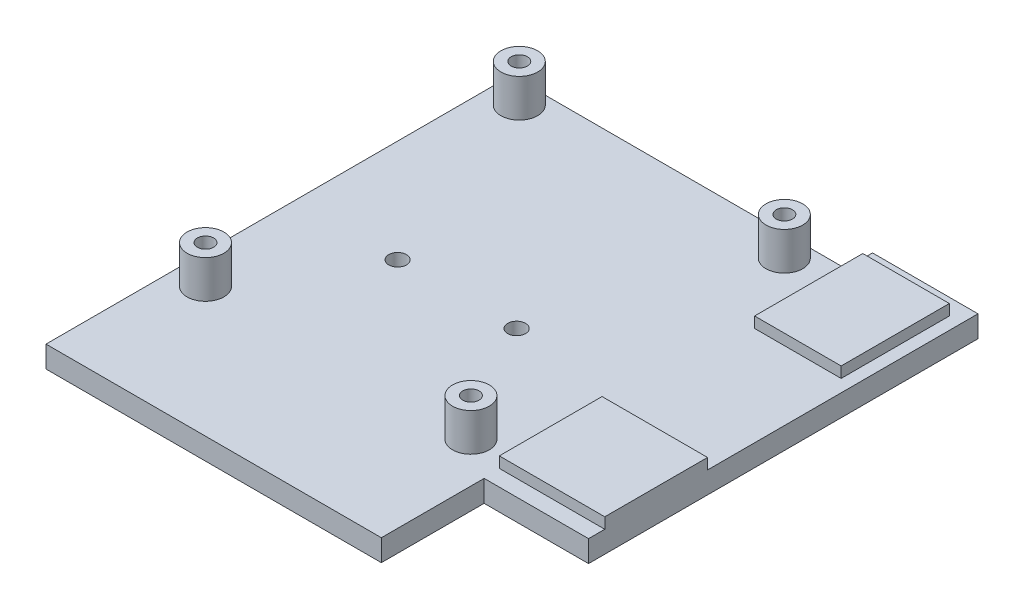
ISO-10303-21;
HEADER;
FILE_DESCRIPTION(('STEP AP214'),'2;1');
FILE_NAME('part.step','',(''),(''),'','','');
FILE_SCHEMA(('AUTOMOTIVE_DESIGN { 1 0 10303 214 1 1 1 1 }'));
ENDSEC;
DATA;
#1=APPLICATION_CONTEXT('core data for automotive mechanical design processes');
#2=APPLICATION_PROTOCOL_DEFINITION('international standard','automotive_design',2000,#1);
#3=PRODUCT_CONTEXT('',#1,'mechanical');
#4=PRODUCT('Part','Part','',(#3));
#5=PRODUCT_RELATED_PRODUCT_CATEGORY('part','',(#4));
#6=PRODUCT_DEFINITION_FORMATION('','',#4);
#7=PRODUCT_DEFINITION_CONTEXT('part definition',#1,'design');
#8=PRODUCT_DEFINITION('design','',#6,#7);
#9=PRODUCT_DEFINITION_SHAPE('','',#8);
#10=(LENGTH_UNIT() NAMED_UNIT(*) SI_UNIT(.MILLI.,.METRE.));
#11=(NAMED_UNIT(*) PLANE_ANGLE_UNIT() SI_UNIT($,.RADIAN.));
#12=(NAMED_UNIT(*) SI_UNIT($,.STERADIAN.) SOLID_ANGLE_UNIT());
#13=UNCERTAINTY_MEASURE_WITH_UNIT(LENGTH_MEASURE(1.E-05),#10,'distance_accuracy_value','');
#14=(GEOMETRIC_REPRESENTATION_CONTEXT(3) GLOBAL_UNCERTAINTY_ASSIGNED_CONTEXT((#13)) GLOBAL_UNIT_ASSIGNED_CONTEXT((#10,
#11,#12)) REPRESENTATION_CONTEXT('',''));
#15=CARTESIAN_POINT('',(0.,0.,0.));
#16=DIRECTION('',(0.,0.,1.));
#17=DIRECTION('',(1.,0.,0.));
#18=AXIS2_PLACEMENT_3D('',#15,#16,#17);
#19=CARTESIAN_POINT('',(33.,19.,-255.));
#20=DIRECTION('',(0.,1.,0.));
#21=DIRECTION('',(0.,0.,1.));
#22=AXIS2_PLACEMENT_3D('',#19,#20,#21);
#23=PLANE('',#22);
#24=DIRECTION('',(1.,0.,0.));
#25=VECTOR('',#24,1.);
#26=CARTESIAN_POINT('',(33.,19.,-235.));
#27=LINE('',#26,#25);
#28=CARTESIAN_POINT('',(49.,19.,-235.));
#29=VERTEX_POINT('',#28);
#30=CARTESIAN_POINT('',(33.,19.,-235.));
#31=VERTEX_POINT('',#30);
#32=EDGE_CURVE('E133',#29,#31,#27,.F.);
#33=ORIENTED_EDGE('',*,*,#32,.F.);
#34=DIRECTION('',(0.,0.,-1.));
#35=VECTOR('',#34,1.);
#36=CARTESIAN_POINT('',(49.,19.,-255.));
#37=LINE('',#36,#35);
#38=CARTESIAN_POINT('',(49.,19.,-255.));
#39=VERTEX_POINT('',#38);
#40=EDGE_CURVE('E283',#39,#29,#37,.F.);
#41=ORIENTED_EDGE('',*,*,#40,.F.);
#42=DIRECTION('',(1.,0.,0.));
#43=VECTOR('',#42,1.);
#44=CARTESIAN_POINT('',(33.,19.,-255.));
#45=LINE('',#44,#43);
#46=CARTESIAN_POINT('',(33.,19.,-255.));
#47=VERTEX_POINT('',#46);
#48=EDGE_CURVE('E147',#39,#47,#45,.F.);
#49=ORIENTED_EDGE('',*,*,#48,.T.);
#50=DIRECTION('',(0.,0.,-1.));
#51=VECTOR('',#50,1.);
#52=CARTESIAN_POINT('',(33.,19.,-255.));
#53=LINE('',#52,#51);
#54=EDGE_CURVE('E127',#47,#31,#53,.F.);
#55=ORIENTED_EDGE('',*,*,#54,.T.);
#56=EDGE_LOOP('',(#33,#41,#49,#55));
#57=FACE_BOUND('',#56,.T.);
#58=ADVANCED_FACE('F16',(#57),#23,.T.);
#59=CARTESIAN_POINT('',(33.,16.9,-235.));
#60=DIRECTION('',(0.,0.,1.));
#61=DIRECTION('',(1.,0.,0.));
#62=AXIS2_PLACEMENT_3D('',#59,#60,#61);
#63=PLANE('',#62);
#64=DIRECTION('',(0.,1.,0.));
#65=VECTOR('',#64,1.);
#66=CARTESIAN_POINT('',(49.,16.9,-235.));
#67=LINE('',#66,#65);
#68=CARTESIAN_POINT('',(49.,17.,-235.));
#69=VERTEX_POINT('',#68);
#70=EDGE_CURVE('E138',#29,#69,#67,.F.);
#71=ORIENTED_EDGE('',*,*,#70,.F.);
#72=ORIENTED_EDGE('',*,*,#32,.T.);
#73=DIRECTION('',(0.,1.,0.));
#74=VECTOR('',#73,1.);
#75=CARTESIAN_POINT('',(33.,16.9,-235.));
#76=LINE('',#75,#74);
#77=CARTESIAN_POINT('',(33.,17.,-235.));
#78=VERTEX_POINT('',#77);
#79=EDGE_CURVE('E136',#31,#78,#76,.F.);
#80=ORIENTED_EDGE('',*,*,#79,.T.);
#81=DIRECTION('',(1.,0.,0.));
#82=VECTOR('',#81,1.);
#83=CARTESIAN_POINT('',(31.8,17.,-235.));
#84=LINE('',#83,#82);
#85=EDGE_CURVE('E266',#69,#78,#84,.F.);
#86=ORIENTED_EDGE('',*,*,#85,.F.);
#87=EDGE_LOOP('',(#71,#72,#80,#86));
#88=FACE_BOUND('',#87,.T.);
#89=ADVANCED_FACE('F134',(#88),#63,.T.);
#90=CARTESIAN_POINT('',(33.,16.9,-255.));
#91=DIRECTION('',(1.,0.,0.));
#92=DIRECTION('',(0.,0.,-1.));
#93=AXIS2_PLACEMENT_3D('',#90,#91,#92);
#94=PLANE('',#93);
#95=DIRECTION('',(0.,1.,0.));
#96=VECTOR('',#95,1.);
#97=CARTESIAN_POINT('',(33.,16.9,-255.));
#98=LINE('',#97,#96);
#99=CARTESIAN_POINT('',(33.,17.,-255.));
#100=VERTEX_POINT('',#99);
#101=EDGE_CURVE('E148',#47,#100,#98,.F.);
#102=ORIENTED_EDGE('',*,*,#101,.T.);
#103=DIRECTION('',(0.,0.,1.));
#104=VECTOR('',#103,1.);
#105=CARTESIAN_POINT('',(33.,17.,-258.));
#106=LINE('',#105,#104);
#107=EDGE_CURVE('E144',#78,#100,#106,.F.);
#108=ORIENTED_EDGE('',*,*,#107,.F.);
#109=ORIENTED_EDGE('',*,*,#79,.F.);
#110=ORIENTED_EDGE('',*,*,#54,.F.);
#111=EDGE_LOOP('',(#102,#108,#109,#110));
#112=FACE_BOUND('',#111,.T.);
#113=ADVANCED_FACE('F143',(#112),#94,.F.);
#114=CARTESIAN_POINT('',(33.,16.9,-255.));
#115=DIRECTION('',(0.,0.,1.));
#116=DIRECTION('',(1.,0.,0.));
#117=AXIS2_PLACEMENT_3D('',#114,#115,#116);
#118=PLANE('',#117);
#119=DIRECTION('',(0.,1.,0.));
#120=VECTOR('',#119,1.);
#121=CARTESIAN_POINT('',(49.,16.9,-255.));
#122=LINE('',#121,#120);
#123=CARTESIAN_POINT('',(49.,17.,-255.));
#124=VERTEX_POINT('',#123);
#125=EDGE_CURVE('E285',#124,#39,#122,.T.);
#126=ORIENTED_EDGE('',*,*,#125,.F.);
#127=DIRECTION('',(1.,0.,0.));
#128=VECTOR('',#127,1.);
#129=CARTESIAN_POINT('',(31.8,17.,-255.));
#130=LINE('',#129,#128);
#131=EDGE_CURVE('E263',#100,#124,#130,.T.);
#132=ORIENTED_EDGE('',*,*,#131,.F.);
#133=ORIENTED_EDGE('',*,*,#101,.F.);
#134=ORIENTED_EDGE('',*,*,#48,.F.);
#135=EDGE_LOOP('',(#126,#132,#133,#134));
#136=FACE_BOUND('',#135,.T.);
#137=ADVANCED_FACE('F296',(#136),#118,.F.);
#138=CARTESIAN_POINT('',(49.,16.9,-255.));
#139=DIRECTION('',(1.,0.,0.));
#140=DIRECTION('',(0.,0.,-1.));
#141=AXIS2_PLACEMENT_3D('',#138,#139,#140);
#142=PLANE('',#141);
#143=ORIENTED_EDGE('',*,*,#125,.T.);
#144=ORIENTED_EDGE('',*,*,#40,.T.);
#145=ORIENTED_EDGE('',*,*,#70,.T.);
#146=DIRECTION('',(0.,0.,1.));
#147=VECTOR('',#146,1.);
#148=CARTESIAN_POINT('',(49.,17.,-258.));
#149=LINE('',#148,#147);
#150=EDGE_CURVE('E260',#124,#69,#149,.T.);
#151=ORIENTED_EDGE('',*,*,#150,.F.);
#152=EDGE_LOOP('',(#143,#144,#145,#151));
#153=FACE_BOUND('',#152,.T.);
#154=ADVANCED_FACE('F290',(#153),#142,.T.);
#155=CARTESIAN_POINT('',(31.8,16.9,-189.));
#156=DIRECTION('',(0.,0.,1.));
#157=DIRECTION('',(1.,0.,0.));
#158=AXIS2_PLACEMENT_3D('',#155,#156,#157);
#159=PLANE('',#158);
#160=DIRECTION('',(0.,1.,0.));
#161=VECTOR('',#160,1.);
#162=CARTESIAN_POINT('',(51.3,16.9,-189.));
#163=LINE('',#162,#161);
#164=CARTESIAN_POINT('',(51.3,17.,-189.));
#165=VERTEX_POINT('',#164);
#166=CARTESIAN_POINT('',(51.3,19.,-189.));
#167=VERTEX_POINT('',#166);
#168=EDGE_CURVE('E281',#165,#167,#163,.T.);
#169=ORIENTED_EDGE('',*,*,#168,.T.);
#170=DIRECTION('',(1.,0.,0.));
#171=VECTOR('',#170,1.);
#172=CARTESIAN_POINT('',(31.8,19.,-189.));
#173=LINE('',#172,#171);
#174=CARTESIAN_POINT('',(31.8,19.,-189.));
#175=VERTEX_POINT('',#174);
#176=EDGE_CURVE('E274',#175,#167,#173,.T.);
#177=ORIENTED_EDGE('',*,*,#176,.F.);
#178=DIRECTION('',(0.,1.,0.));
#179=VECTOR('',#178,1.);
#180=CARTESIAN_POINT('',(31.8,16.9,-189.));
#181=LINE('',#180,#179);
#182=CARTESIAN_POINT('',(31.8,17.,-189.));
#183=VERTEX_POINT('',#182);
#184=EDGE_CURVE('E245',#175,#183,#181,.F.);
#185=ORIENTED_EDGE('',*,*,#184,.T.);
#186=DIRECTION('',(1.,0.,0.));
#187=VECTOR('',#186,1.);
#188=CARTESIAN_POINT('',(-30.,17.,-189.));
#189=LINE('',#188,#187);
#190=EDGE_CURVE('E248',#165,#183,#189,.F.);
#191=ORIENTED_EDGE('',*,*,#190,.F.);
#192=EDGE_LOOP('',(#169,#177,#185,#191));
#193=FACE_BOUND('',#192,.T.);
#194=ADVANCED_FACE('F304',(#193),#159,.T.);
#195=CARTESIAN_POINT('',(31.8,16.9,-208.));
#196=DIRECTION('',(0.,0.,1.));
#197=DIRECTION('',(1.,0.,0.));
#198=AXIS2_PLACEMENT_3D('',#195,#196,#197);
#199=PLANE('',#198);
#200=DIRECTION('',(0.,1.,0.));
#201=VECTOR('',#200,1.);
#202=CARTESIAN_POINT('',(51.3,16.9,-208.));
#203=LINE('',#202,#201);
#204=CARTESIAN_POINT('',(51.3,17.,-208.));
#205=VERTEX_POINT('',#204);
#206=CARTESIAN_POINT('',(51.3,19.,-208.));
#207=VERTEX_POINT('',#206);
#208=EDGE_CURVE('E279',#205,#207,#203,.T.);
#209=ORIENTED_EDGE('',*,*,#208,.F.);
#210=DIRECTION('',(1.,0.,0.));
#211=VECTOR('',#210,1.);
#212=CARTESIAN_POINT('',(31.8,17.,-208.));
#213=LINE('',#212,#211);
#214=CARTESIAN_POINT('',(31.8,17.,-208.));
#215=VERTEX_POINT('',#214);
#216=EDGE_CURVE('E268',#215,#205,#213,.T.);
#217=ORIENTED_EDGE('',*,*,#216,.F.);
#218=DIRECTION('',(0.,1.,0.));
#219=VECTOR('',#218,1.);
#220=CARTESIAN_POINT('',(31.8,16.9,-208.));
#221=LINE('',#220,#219);
#222=CARTESIAN_POINT('',(31.8,19.,-208.));
#223=VERTEX_POINT('',#222);
#224=EDGE_CURVE('E242',#215,#223,#221,.T.);
#225=ORIENTED_EDGE('',*,*,#224,.T.);
#226=DIRECTION('',(1.,0.,0.));
#227=VECTOR('',#226,1.);
#228=CARTESIAN_POINT('',(31.8,19.,-208.));
#229=LINE('',#228,#227);
#230=EDGE_CURVE('E277',#207,#223,#229,.F.);
#231=ORIENTED_EDGE('',*,*,#230,.F.);
#232=EDGE_LOOP('',(#209,#217,#225,#231));
#233=FACE_BOUND('',#232,.T.);
#234=ADVANCED_FACE('F412',(#233),#199,.F.);
#235=CARTESIAN_POINT('',(31.8,19.,-208.));
#236=DIRECTION('',(0.,1.,0.));
#237=DIRECTION('',(0.,0.,1.));
#238=AXIS2_PLACEMENT_3D('',#235,#236,#237);
#239=PLANE('',#238);
#240=ORIENTED_EDGE('',*,*,#176,.T.);
#241=DIRECTION('',(0.,0.,1.));
#242=VECTOR('',#241,1.);
#243=CARTESIAN_POINT('',(51.3,19.,-208.));
#244=LINE('',#243,#242);
#245=EDGE_CURVE('E271',#167,#207,#244,.F.);
#246=ORIENTED_EDGE('',*,*,#245,.T.);
#247=ORIENTED_EDGE('',*,*,#230,.T.);
#248=DIRECTION('',(0.,0.,-1.));
#249=VECTOR('',#248,1.);
#250=CARTESIAN_POINT('',(31.8,19.,-208.));
#251=LINE('',#250,#249);
#252=EDGE_CURVE('E239',#223,#175,#251,.F.);
#253=ORIENTED_EDGE('',*,*,#252,.T.);
#254=EDGE_LOOP('',(#240,#246,#247,#253));
#255=FACE_BOUND('',#254,.T.);
#256=ADVANCED_FACE('F408',(#255),#239,.T.);
#257=CARTESIAN_POINT('',(51.3,13.,-258.));
#258=DIRECTION('',(1.,0.,0.));
#259=DIRECTION('',(0.,0.,-1.));
#260=AXIS2_PLACEMENT_3D('',#257,#258,#259);
#261=PLANE('',#260);
#262=DIRECTION('',(0.,0.,-1.));
#263=VECTOR('',#262,1.);
#264=CARTESIAN_POINT('',(51.3,17.,-258.));
#265=LINE('',#264,#263);
#266=CARTESIAN_POINT('',(51.3,17.,-258.));
#267=VERTEX_POINT('',#266);
#268=EDGE_CURVE('E257',#267,#205,#265,.F.);
#269=ORIENTED_EDGE('',*,*,#268,.T.);
#270=ORIENTED_EDGE('',*,*,#208,.T.);
#271=ORIENTED_EDGE('',*,*,#245,.F.);
#272=ORIENTED_EDGE('',*,*,#168,.F.);
#273=DIRECTION('',(0.,0.,-1.));
#274=VECTOR('',#273,1.);
#275=CARTESIAN_POINT('',(51.3,17.,-258.));
#276=LINE('',#275,#274);
#277=CARTESIAN_POINT('',(51.3,17.,-186.));
#278=VERTEX_POINT('',#277);
#279=EDGE_CURVE('E255',#165,#278,#276,.F.);
#280=ORIENTED_EDGE('',*,*,#279,.T.);
#281=DIRECTION('',(0.,1.,0.));
#282=VECTOR('',#281,1.);
#283=CARTESIAN_POINT('',(51.3,13.,-186.));
#284=LINE('',#283,#282);
#285=CARTESIAN_POINT('',(51.3,13.,-186.));
#286=VERTEX_POINT('',#285);
#287=EDGE_CURVE('E229',#286,#278,#284,.T.);
#288=ORIENTED_EDGE('',*,*,#287,.F.);
#289=DIRECTION('',(0.,0.,1.));
#290=VECTOR('',#289,1.);
#291=CARTESIAN_POINT('',(51.3,13.,-258.));
#292=LINE('',#291,#290);
#293=CARTESIAN_POINT('',(51.3,13.,-258.));
#294=VERTEX_POINT('',#293);
#295=EDGE_CURVE('E226',#286,#294,#292,.F.);
#296=ORIENTED_EDGE('',*,*,#295,.T.);
#297=DIRECTION('',(0.,1.,0.));
#298=VECTOR('',#297,1.);
#299=CARTESIAN_POINT('',(51.3,13.,-258.));
#300=LINE('',#299,#298);
#301=EDGE_CURVE('E252',#294,#267,#300,.T.);
#302=ORIENTED_EDGE('',*,*,#301,.T.);
#303=EDGE_LOOP('',(#269,#270,#271,#272,#280,#288,#296,#302));
#304=FACE_BOUND('',#303,.T.);
#305=ADVANCED_FACE('F404',(#304),#261,.T.);
#306=CARTESIAN_POINT('',(31.8,13.,-258.));
#307=DIRECTION('',(0.,0.,1.));
#308=DIRECTION('',(1.,0.,0.));
#309=AXIS2_PLACEMENT_3D('',#306,#307,#308);
#310=PLANE('',#309);
#311=ORIENTED_EDGE('',*,*,#301,.F.);
#312=DIRECTION('',(1.,0.,0.));
#313=VECTOR('',#312,1.);
#314=CARTESIAN_POINT('',(31.8,13.,-258.));
#315=LINE('',#314,#313);
#316=CARTESIAN_POINT('',(31.8,13.,-258.));
#317=VERTEX_POINT('',#316);
#318=EDGE_CURVE('E219',#294,#317,#315,.F.);
#319=ORIENTED_EDGE('',*,*,#318,.T.);
#320=DIRECTION('',(0.,1.,0.));
#321=VECTOR('',#320,1.);
#322=CARTESIAN_POINT('',(31.8,13.,-258.));
#323=LINE('',#322,#321);
#324=CARTESIAN_POINT('',(31.8,17.,-258.));
#325=VERTEX_POINT('',#324);
#326=EDGE_CURVE('E236',#317,#325,#323,.T.);
#327=ORIENTED_EDGE('',*,*,#326,.T.);
#328=DIRECTION('',(1.,0.,0.));
#329=VECTOR('',#328,1.);
#330=CARTESIAN_POINT('',(31.8,17.,-258.));
#331=LINE('',#330,#329);
#332=EDGE_CURVE('E250',#267,#325,#331,.F.);
#333=ORIENTED_EDGE('',*,*,#332,.F.);
#334=EDGE_LOOP('',(#311,#319,#327,#333));
#335=FACE_BOUND('',#334,.T.);
#336=ADVANCED_FACE('F400',(#335),#310,.F.);
#337=CARTESIAN_POINT('',(31.8,16.9,-208.));
#338=DIRECTION('',(1.,0.,0.));
#339=DIRECTION('',(0.,0.,-1.));
#340=AXIS2_PLACEMENT_3D('',#337,#338,#339);
#341=PLANE('',#340);
#342=ORIENTED_EDGE('',*,*,#224,.F.);
#343=DIRECTION('',(0.,0.,1.));
#344=VECTOR('',#343,1.);
#345=CARTESIAN_POINT('',(31.8,17.,-253.));
#346=LINE('',#345,#344);
#347=EDGE_CURVE('E204',#183,#215,#346,.F.);
#348=ORIENTED_EDGE('',*,*,#347,.F.);
#349=ORIENTED_EDGE('',*,*,#184,.F.);
#350=ORIENTED_EDGE('',*,*,#252,.F.);
#351=EDGE_LOOP('',(#342,#348,#349,#350));
#352=FACE_BOUND('',#351,.T.);
#353=ADVANCED_FACE('F396',(#352),#341,.F.);
#354=CARTESIAN_POINT('',(-24.5099,16.8,-249.0098));
#355=DIRECTION('',(0.,1.,0.));
#356=DIRECTION('',(0.,0.,1.));
#357=AXIS2_PLACEMENT_3D('',#354,#355,#356);
#358=CYLINDRICAL_SURFACE('',#357,3.4);
#359=CARTESIAN_POINT('',(-24.5099,24.,-249.0098));
#360=DIRECTION('',(0.,1.,0.));
#361=DIRECTION('',(0.,0.,1.));
#362=AXIS2_PLACEMENT_3D('',#359,#360,#361);
#363=CIRCLE('',#362,3.4);
#364=CARTESIAN_POINT('',(-24.5099,24.,-245.6098));
#365=VERTEX_POINT('',#364);
#366=EDGE_CURVE('E19',#365,#365,#363,.T.);
#367=ORIENTED_EDGE('',*,*,#366,.F.);
#368=EDGE_LOOP('',(#367));
#369=FACE_BOUND('',#368,.T.);
#370=CARTESIAN_POINT('',(-24.5099,17.,-249.0098));
#371=DIRECTION('',(0.,1.,0.));
#372=DIRECTION('',(0.,0.,1.));
#373=AXIS2_PLACEMENT_3D('',#370,#371,#372);
#374=CIRCLE('',#373,3.4);
#375=CARTESIAN_POINT('',(-24.5099,17.,-245.6098));
#376=VERTEX_POINT('',#375);
#377=EDGE_CURVE('E201',#376,#376,#374,.F.);
#378=ORIENTED_EDGE('',*,*,#377,.F.);
#379=EDGE_LOOP('',(#378));
#380=FACE_BOUND('',#379,.T.);
#381=ADVANCED_FACE('F392',(#369,#380),#358,.T.);
#382=CARTESIAN_POINT('',(-24.5024,16.8,-190.9868));
#383=DIRECTION('',(0.,1.,0.));
#384=DIRECTION('',(0.,0.,1.));
#385=AXIS2_PLACEMENT_3D('',#382,#383,#384);
#386=CYLINDRICAL_SURFACE('',#385,3.4);
#387=CARTESIAN_POINT('',(-24.5024,24.,-190.9868));
#388=DIRECTION('',(0.,1.,0.));
#389=DIRECTION('',(0.,0.,1.));
#390=AXIS2_PLACEMENT_3D('',#387,#388,#389);
#391=CIRCLE('',#390,3.4);
#392=CARTESIAN_POINT('',(-24.5024,24.,-187.5868));
#393=VERTEX_POINT('',#392);
#394=EDGE_CURVE('E207',#393,#393,#391,.T.);
#395=ORIENTED_EDGE('',*,*,#394,.F.);
#396=EDGE_LOOP('',(#395));
#397=FACE_BOUND('',#396,.T.);
#398=CARTESIAN_POINT('',(-24.5024,17.,-190.9868));
#399=DIRECTION('',(0.,1.,0.));
#400=DIRECTION('',(0.,0.,1.));
#401=AXIS2_PLACEMENT_3D('',#398,#399,#400);
#402=CIRCLE('',#401,3.4);
#403=CARTESIAN_POINT('',(-24.5024,17.,-187.5868));
#404=VERTEX_POINT('',#403);
#405=EDGE_CURVE('E198',#404,#404,#402,.F.);
#406=ORIENTED_EDGE('',*,*,#405,.F.);
#407=EDGE_LOOP('',(#406));
#408=FACE_BOUND('',#407,.T.);
#409=ADVANCED_FACE('F388',(#397,#408),#386,.T.);
#410=CARTESIAN_POINT('',(24.49,16.8,-249.0098));
#411=DIRECTION('',(0.,1.,0.));
#412=DIRECTION('',(0.,0.,1.));
#413=AXIS2_PLACEMENT_3D('',#410,#411,#412);
#414=CYLINDRICAL_SURFACE('',#413,3.4);
#415=CARTESIAN_POINT('',(24.49,24.,-249.0098));
#416=DIRECTION('',(0.,1.,0.));
#417=DIRECTION('',(0.,0.,1.));
#418=AXIS2_PLACEMENT_3D('',#415,#416,#417);
#419=CIRCLE('',#418,3.4);
#420=CARTESIAN_POINT('',(24.49,24.,-245.6098));
#421=VERTEX_POINT('',#420);
#422=EDGE_CURVE('E205',#421,#421,#419,.T.);
#423=ORIENTED_EDGE('',*,*,#422,.F.);
#424=EDGE_LOOP('',(#423));
#425=FACE_BOUND('',#424,.T.);
#426=CARTESIAN_POINT('',(24.49,17.,-249.0098));
#427=DIRECTION('',(0.,1.,0.));
#428=DIRECTION('',(0.,0.,1.));
#429=AXIS2_PLACEMENT_3D('',#426,#427,#428);
#430=CIRCLE('',#429,3.4);
#431=CARTESIAN_POINT('',(24.49,17.,-245.6098));
#432=VERTEX_POINT('',#431);
#433=EDGE_CURVE('E195',#432,#432,#430,.F.);
#434=ORIENTED_EDGE('',*,*,#433,.F.);
#435=EDGE_LOOP('',(#434));
#436=FACE_BOUND('',#435,.T.);
#437=ADVANCED_FACE('F384',(#425,#436),#414,.T.);
#438=CARTESIAN_POINT('',(24.5162,16.8,-191.0386));
#439=DIRECTION('',(0.,1.,0.));
#440=DIRECTION('',(0.,0.,1.));
#441=AXIS2_PLACEMENT_3D('',#438,#439,#440);
#442=CYLINDRICAL_SURFACE('',#441,3.4);
#443=CARTESIAN_POINT('',(24.5162,24.,-191.0386));
#444=DIRECTION('',(0.,1.,0.));
#445=DIRECTION('',(0.,0.,1.));
#446=AXIS2_PLACEMENT_3D('',#443,#444,#445);
#447=CIRCLE('',#446,3.4);
#448=CARTESIAN_POINT('',(24.5162,24.,-187.6386));
#449=VERTEX_POINT('',#448);
#450=EDGE_CURVE('E188',#449,#449,#447,.T.);
#451=ORIENTED_EDGE('',*,*,#450,.F.);
#452=EDGE_LOOP('',(#451));
#453=FACE_BOUND('',#452,.T.);
#454=CARTESIAN_POINT('',(24.5162,17.,-191.0386));
#455=DIRECTION('',(0.,1.,0.));
#456=DIRECTION('',(0.,0.,1.));
#457=AXIS2_PLACEMENT_3D('',#454,#455,#456);
#458=CIRCLE('',#457,3.4);
#459=CARTESIAN_POINT('',(24.5162,17.,-187.6386));
#460=VERTEX_POINT('',#459);
#461=EDGE_CURVE('E192',#460,#460,#458,.F.);
#462=ORIENTED_EDGE('',*,*,#461,.F.);
#463=EDGE_LOOP('',(#462));
#464=FACE_BOUND('',#463,.T.);
#465=ADVANCED_FACE('F380',(#453,#464),#442,.T.);
#466=CARTESIAN_POINT('',(31.8,13.,-258.));
#467=DIRECTION('',(1.,0.,0.));
#468=DIRECTION('',(0.,0.,-1.));
#469=AXIS2_PLACEMENT_3D('',#466,#467,#468);
#470=PLANE('',#469);
#471=DIRECTION('',(0.,0.,-1.));
#472=VECTOR('',#471,1.);
#473=CARTESIAN_POINT('',(31.8,17.,-258.));
#474=LINE('',#473,#472);
#475=CARTESIAN_POINT('',(31.8,17.,-253.));
#476=VERTEX_POINT('',#475);
#477=EDGE_CURVE('E233',#325,#476,#474,.F.);
#478=ORIENTED_EDGE('',*,*,#477,.F.);
#479=ORIENTED_EDGE('',*,*,#326,.F.);
#480=DIRECTION('',(0.,0.,1.));
#481=VECTOR('',#480,1.);
#482=CARTESIAN_POINT('',(31.8,13.,-258.));
#483=LINE('',#482,#481);
#484=CARTESIAN_POINT('',(31.8,13.,-253.));
#485=VERTEX_POINT('',#484);
#486=EDGE_CURVE('E214',#317,#485,#483,.T.);
#487=ORIENTED_EDGE('',*,*,#486,.T.);
#488=DIRECTION('',(0.,1.,0.));
#489=VECTOR('',#488,1.);
#490=CARTESIAN_POINT('',(31.8,13.,-253.));
#491=LINE('',#490,#489);
#492=EDGE_CURVE('E456',#485,#476,#491,.T.);
#493=ORIENTED_EDGE('',*,*,#492,.T.);
#494=EDGE_LOOP('',(#478,#479,#487,#493));
#495=FACE_BOUND('',#494,.T.);
#496=ADVANCED_FACE('F377',(#495),#470,.F.);
#497=CARTESIAN_POINT('',(31.8,13.,-186.));
#498=DIRECTION('',(0.,0.,1.));
#499=DIRECTION('',(1.,0.,0.));
#500=AXIS2_PLACEMENT_3D('',#497,#498,#499);
#501=PLANE('',#500);
#502=DIRECTION('',(1.,0.,0.));
#503=VECTOR('',#502,1.);
#504=CARTESIAN_POINT('',(31.8,13.,-186.));
#505=LINE('',#504,#503);
#506=CARTESIAN_POINT('',(32.,13.,-186.));
#507=VERTEX_POINT('',#506);
#508=EDGE_CURVE('E34',#507,#286,#505,.T.);
#509=ORIENTED_EDGE('',*,*,#508,.T.);
#510=ORIENTED_EDGE('',*,*,#287,.T.);
#511=DIRECTION('',(1.,0.,0.));
#512=VECTOR('',#511,1.);
#513=CARTESIAN_POINT('',(31.8,17.,-186.));
#514=LINE('',#513,#512);
#515=CARTESIAN_POINT('',(32.,17.,-186.));
#516=VERTEX_POINT('',#515);
#517=EDGE_CURVE('E231',#278,#516,#514,.F.);
#518=ORIENTED_EDGE('',*,*,#517,.T.);
#519=DIRECTION('',(0.,1.,0.));
#520=VECTOR('',#519,1.);
#521=CARTESIAN_POINT('',(32.,13.,-186.));
#522=LINE('',#521,#520);
#523=EDGE_CURVE('E436',#507,#516,#522,.T.);
#524=ORIENTED_EDGE('',*,*,#523,.F.);
#525=EDGE_LOOP('',(#509,#510,#518,#524));
#526=FACE_BOUND('',#525,.T.);
#527=ADVANCED_FACE('F373',(#526),#501,.T.);
#528=CARTESIAN_POINT('',(-24.5099,24.,-249.0098));
#529=DIRECTION('',(0.,1.,0.));
#530=DIRECTION('',(0.,0.,1.));
#531=AXIS2_PLACEMENT_3D('',#528,#529,#530);
#532=PLANE('',#531);
#533=CARTESIAN_POINT('',(-24.5099,24.,-249.0098));
#534=DIRECTION('',(0.,1.,0.));
#535=DIRECTION('',(0.,0.,1.));
#536=AXIS2_PLACEMENT_3D('',#533,#534,#535);
#537=CIRCLE('',#536,1.5);
#538=CARTESIAN_POINT('',(-24.5099,24.,-247.5098));
#539=VERTEX_POINT('',#538);
#540=EDGE_CURVE('E184',#539,#539,#537,.F.);
#541=ORIENTED_EDGE('',*,*,#540,.T.);
#542=EDGE_LOOP('',(#541));
#543=FACE_BOUND('',#542,.T.);
#544=ORIENTED_EDGE('',*,*,#366,.T.);
#545=EDGE_LOOP('',(#544));
#546=FACE_BOUND('',#545,.T.);
#547=ADVANCED_FACE('F369',(#543,#546),#532,.T.);
#548=CARTESIAN_POINT('',(-24.5024,24.,-190.9868));
#549=DIRECTION('',(0.,1.,0.));
#550=DIRECTION('',(0.,0.,1.));
#551=AXIS2_PLACEMENT_3D('',#548,#549,#550);
#552=PLANE('',#551);
#553=CARTESIAN_POINT('',(-24.5024,24.,-190.9868));
#554=DIRECTION('',(0.,1.,0.));
#555=DIRECTION('',(0.,0.,1.));
#556=AXIS2_PLACEMENT_3D('',#553,#554,#555);
#557=CIRCLE('',#556,1.5);
#558=CARTESIAN_POINT('',(-24.5024,24.,-189.4868));
#559=VERTEX_POINT('',#558);
#560=EDGE_CURVE('E181',#559,#559,#557,.F.);
#561=ORIENTED_EDGE('',*,*,#560,.T.);
#562=EDGE_LOOP('',(#561));
#563=FACE_BOUND('',#562,.T.);
#564=ORIENTED_EDGE('',*,*,#394,.T.);
#565=EDGE_LOOP('',(#564));
#566=FACE_BOUND('',#565,.T.);
#567=ADVANCED_FACE('F365',(#563,#566),#552,.T.);
#568=CARTESIAN_POINT('',(24.49,24.,-249.0098));
#569=DIRECTION('',(0.,1.,0.));
#570=DIRECTION('',(0.,0.,1.));
#571=AXIS2_PLACEMENT_3D('',#568,#569,#570);
#572=PLANE('',#571);
#573=CARTESIAN_POINT('',(24.49,24.,-249.0098));
#574=DIRECTION('',(0.,1.,0.));
#575=DIRECTION('',(0.,0.,1.));
#576=AXIS2_PLACEMENT_3D('',#573,#574,#575);
#577=CIRCLE('',#576,1.5);
#578=CARTESIAN_POINT('',(24.49,24.,-247.5098));
#579=VERTEX_POINT('',#578);
#580=EDGE_CURVE('E175',#579,#579,#577,.F.);
#581=ORIENTED_EDGE('',*,*,#580,.T.);
#582=EDGE_LOOP('',(#581));
#583=FACE_BOUND('',#582,.T.);
#584=ORIENTED_EDGE('',*,*,#422,.T.);
#585=EDGE_LOOP('',(#584));
#586=FACE_BOUND('',#585,.T.);
#587=ADVANCED_FACE('F361',(#583,#586),#572,.T.);
#588=CARTESIAN_POINT('',(-30.,17.,-253.));
#589=DIRECTION('',(0.,1.,0.));
#590=DIRECTION('',(0.,0.,1.));
#591=AXIS2_PLACEMENT_3D('',#588,#589,#590);
#592=PLANE('',#591);
#593=ORIENTED_EDGE('',*,*,#477,.T.);
#594=DIRECTION('',(1.,0.,0.));
#595=VECTOR('',#594,1.);
#596=CARTESIAN_POINT('',(-30.,17.,-253.));
#597=LINE('',#596,#595);
#598=CARTESIAN_POINT('',(-30.,17.,-253.));
#599=VERTEX_POINT('',#598);
#600=EDGE_CURVE('E191',#476,#599,#597,.F.);
#601=ORIENTED_EDGE('',*,*,#600,.T.);
#602=DIRECTION('',(0.,0.,-1.));
#603=VECTOR('',#602,1.);
#604=CARTESIAN_POINT('',(-30.,17.,-253.));
#605=LINE('',#604,#603);
#606=CARTESIAN_POINT('',(-30.,17.,-167.));
#607=VERTEX_POINT('',#606);
#608=EDGE_CURVE('E451',#599,#607,#605,.F.);
#609=ORIENTED_EDGE('',*,*,#608,.T.);
#610=DIRECTION('',(1.,0.,0.));
#611=VECTOR('',#610,1.);
#612=CARTESIAN_POINT('',(-30.,17.,-167.));
#613=LINE('',#612,#611);
#614=CARTESIAN_POINT('',(32.,17.,-167.));
#615=VERTEX_POINT('',#614);
#616=EDGE_CURVE('E440',#615,#607,#613,.F.);
#617=ORIENTED_EDGE('',*,*,#616,.F.);
#618=DIRECTION('',(0.,0.,-1.));
#619=VECTOR('',#618,1.);
#620=CARTESIAN_POINT('',(32.,17.,-253.));
#621=LINE('',#620,#619);
#622=EDGE_CURVE('E438',#516,#615,#621,.F.);
#623=ORIENTED_EDGE('',*,*,#622,.F.);
#624=ORIENTED_EDGE('',*,*,#517,.F.);
#625=ORIENTED_EDGE('',*,*,#279,.F.);
#626=ORIENTED_EDGE('',*,*,#190,.T.);
#627=ORIENTED_EDGE('',*,*,#347,.T.);
#628=ORIENTED_EDGE('',*,*,#216,.T.);
#629=ORIENTED_EDGE('',*,*,#268,.F.);
#630=ORIENTED_EDGE('',*,*,#332,.T.);
#631=EDGE_LOOP('',(#593,#601,#609,#617,#623,#624,#625,#626,#627,#628,#629,#630));
#632=FACE_BOUND('',#631,.T.);
#633=ORIENTED_EDGE('',*,*,#461,.T.);
#634=EDGE_LOOP('',(#633));
#635=FACE_BOUND('',#634,.T.);
#636=CARTESIAN_POINT('',(11.,17.,-213.));
#637=DIRECTION('',(0.,1.,0.));
#638=DIRECTION('',(0.,0.,1.));
#639=AXIS2_PLACEMENT_3D('',#636,#637,#638);
#640=CIRCLE('',#639,1.65);
#641=CARTESIAN_POINT('',(11.,17.,-211.35));
#642=VERTEX_POINT('',#641);
#643=EDGE_CURVE('E172',#642,#642,#640,.F.);
#644=ORIENTED_EDGE('',*,*,#643,.T.);
#645=EDGE_LOOP('',(#644));
#646=FACE_BOUND('',#645,.T.);
#647=ORIENTED_EDGE('',*,*,#433,.T.);
#648=EDGE_LOOP('',(#647));
#649=FACE_BOUND('',#648,.T.);
#650=CARTESIAN_POINT('',(-11.,17.,-213.));
#651=DIRECTION('',(0.,1.,0.));
#652=DIRECTION('',(0.,0.,1.));
#653=AXIS2_PLACEMENT_3D('',#650,#651,#652);
#654=CIRCLE('',#653,1.65);
#655=CARTESIAN_POINT('',(-11.,17.,-211.35));
#656=VERTEX_POINT('',#655);
#657=EDGE_CURVE('E178',#656,#656,#654,.F.);
#658=ORIENTED_EDGE('',*,*,#657,.T.);
#659=EDGE_LOOP('',(#658));
#660=FACE_BOUND('',#659,.T.);
#661=ORIENTED_EDGE('',*,*,#405,.T.);
#662=EDGE_LOOP('',(#661));
#663=FACE_BOUND('',#662,.T.);
#664=ORIENTED_EDGE('',*,*,#377,.T.);
#665=EDGE_LOOP('',(#664));
#666=FACE_BOUND('',#665,.T.);
#667=ORIENTED_EDGE('',*,*,#131,.T.);
#668=ORIENTED_EDGE('',*,*,#150,.T.);
#669=ORIENTED_EDGE('',*,*,#85,.T.);
#670=ORIENTED_EDGE('',*,*,#107,.T.);
#671=EDGE_LOOP('',(#667,#668,#669,#670));
#672=FACE_BOUND('',#671,.T.);
#673=ADVANCED_FACE('F292',(#632,#635,#646,#649,#660,#663,#666,#672),#592,.T.);
#674=CARTESIAN_POINT('',(24.5162,24.,-191.0386));
#675=DIRECTION('',(0.,1.,0.));
#676=DIRECTION('',(0.,0.,1.));
#677=AXIS2_PLACEMENT_3D('',#674,#675,#676);
#678=PLANE('',#677);
#679=CARTESIAN_POINT('',(24.5162,24.,-191.0386));
#680=DIRECTION('',(0.,1.,0.));
#681=DIRECTION('',(0.,0.,1.));
#682=AXIS2_PLACEMENT_3D('',#679,#680,#681);
#683=CIRCLE('',#682,1.5);
#684=CARTESIAN_POINT('',(24.5162,24.,-189.5386));
#685=VERTEX_POINT('',#684);
#686=EDGE_CURVE('E168',#685,#685,#683,.F.);
#687=ORIENTED_EDGE('',*,*,#686,.T.);
#688=EDGE_LOOP('',(#687));
#689=FACE_BOUND('',#688,.T.);
#690=ORIENTED_EDGE('',*,*,#450,.T.);
#691=EDGE_LOOP('',(#690));
#692=FACE_BOUND('',#691,.T.);
#693=ADVANCED_FACE('F354',(#689,#692),#678,.T.);
#694=CARTESIAN_POINT('',(-30.,13.,-253.));
#695=DIRECTION('',(0.,0.,1.));
#696=DIRECTION('',(1.,0.,0.));
#697=AXIS2_PLACEMENT_3D('',#694,#695,#696);
#698=PLANE('',#697);
#699=DIRECTION('',(1.,0.,0.));
#700=VECTOR('',#699,1.);
#701=CARTESIAN_POINT('',(-30.,13.,-253.));
#702=LINE('',#701,#700);
#703=CARTESIAN_POINT('',(-30.,13.,-253.));
#704=VERTEX_POINT('',#703);
#705=EDGE_CURVE('E171',#485,#704,#702,.F.);
#706=ORIENTED_EDGE('',*,*,#705,.T.);
#707=DIRECTION('',(0.,1.,0.));
#708=VECTOR('',#707,1.);
#709=CARTESIAN_POINT('',(-30.,13.,-253.));
#710=LINE('',#709,#708);
#711=EDGE_CURVE('E453',#704,#599,#710,.T.);
#712=ORIENTED_EDGE('',*,*,#711,.T.);
#713=ORIENTED_EDGE('',*,*,#600,.F.);
#714=ORIENTED_EDGE('',*,*,#492,.F.);
#715=EDGE_LOOP('',(#706,#712,#713,#714));
#716=FACE_BOUND('',#715,.T.);
#717=ADVANCED_FACE('F350',(#716),#698,.F.);
#718=CARTESIAN_POINT('',(-30.,13.,-253.));
#719=DIRECTION('',(1.,0.,0.));
#720=DIRECTION('',(0.,0.,-1.));
#721=AXIS2_PLACEMENT_3D('',#718,#719,#720);
#722=PLANE('',#721);
#723=ORIENTED_EDGE('',*,*,#608,.F.);
#724=ORIENTED_EDGE('',*,*,#711,.F.);
#725=DIRECTION('',(0.,0.,1.));
#726=VECTOR('',#725,1.);
#727=CARTESIAN_POINT('',(-30.,13.,-253.));
#728=LINE('',#727,#726);
#729=CARTESIAN_POINT('',(-30.,13.,-167.));
#730=VERTEX_POINT('',#729);
#731=EDGE_CURVE('E465',#704,#730,#728,.T.);
#732=ORIENTED_EDGE('',*,*,#731,.T.);
#733=DIRECTION('',(0.,1.,0.));
#734=VECTOR('',#733,1.);
#735=CARTESIAN_POINT('',(-30.,13.,-167.));
#736=LINE('',#735,#734);
#737=EDGE_CURVE('E449',#607,#730,#736,.F.);
#738=ORIENTED_EDGE('',*,*,#737,.F.);
#739=EDGE_LOOP('',(#723,#724,#732,#738));
#740=FACE_BOUND('',#739,.T.);
#741=ADVANCED_FACE('F346',(#740),#722,.F.);
#742=CARTESIAN_POINT('',(-30.,13.,-167.));
#743=DIRECTION('',(0.,0.,1.));
#744=DIRECTION('',(1.,0.,0.));
#745=AXIS2_PLACEMENT_3D('',#742,#743,#744);
#746=PLANE('',#745);
#747=DIRECTION('',(0.,1.,0.));
#748=VECTOR('',#747,1.);
#749=CARTESIAN_POINT('',(32.,13.,-167.));
#750=LINE('',#749,#748);
#751=CARTESIAN_POINT('',(32.,13.,-167.));
#752=VERTEX_POINT('',#751);
#753=EDGE_CURVE('E187',#615,#752,#750,.F.);
#754=ORIENTED_EDGE('',*,*,#753,.F.);
#755=ORIENTED_EDGE('',*,*,#616,.T.);
#756=ORIENTED_EDGE('',*,*,#737,.T.);
#757=DIRECTION('',(1.,0.,0.));
#758=VECTOR('',#757,1.);
#759=CARTESIAN_POINT('',(-30.,13.,-167.));
#760=LINE('',#759,#758);
#761=EDGE_CURVE('E466',#730,#752,#760,.T.);
#762=ORIENTED_EDGE('',*,*,#761,.T.);
#763=EDGE_LOOP('',(#754,#755,#756,#762));
#764=FACE_BOUND('',#763,.T.);
#765=ADVANCED_FACE('F342',(#764),#746,.T.);
#766=CARTESIAN_POINT('',(32.,13.,-253.));
#767=DIRECTION('',(1.,0.,0.));
#768=DIRECTION('',(0.,0.,-1.));
#769=AXIS2_PLACEMENT_3D('',#766,#767,#768);
#770=PLANE('',#769);
#771=ORIENTED_EDGE('',*,*,#622,.T.);
#772=ORIENTED_EDGE('',*,*,#753,.T.);
#773=DIRECTION('',(0.,0.,1.));
#774=VECTOR('',#773,1.);
#775=CARTESIAN_POINT('',(32.,13.,-253.));
#776=LINE('',#775,#774);
#777=EDGE_CURVE('E167',#752,#507,#776,.F.);
#778=ORIENTED_EDGE('',*,*,#777,.T.);
#779=ORIENTED_EDGE('',*,*,#523,.T.);
#780=EDGE_LOOP('',(#771,#772,#778,#779));
#781=FACE_BOUND('',#780,.T.);
#782=ADVANCED_FACE('F338',(#781),#770,.T.);
#783=CARTESIAN_POINT('',(-24.5099,12.7,-249.0098));
#784=DIRECTION('',(0.,1.,0.));
#785=DIRECTION('',(0.,0.,1.));
#786=AXIS2_PLACEMENT_3D('',#783,#784,#785);
#787=CYLINDRICAL_SURFACE('',#786,1.5);
#788=CARTESIAN_POINT('',(-24.5099,13.,-249.0098));
#789=DIRECTION('',(0.,1.,0.));
#790=DIRECTION('',(0.,0.,1.));
#791=AXIS2_PLACEMENT_3D('',#788,#789,#790);
#792=CIRCLE('',#791,1.5);
#793=CARTESIAN_POINT('',(-24.5099,13.,-247.5098));
#794=VERTEX_POINT('',#793);
#795=EDGE_CURVE('E164',#794,#794,#792,.F.);
#796=ORIENTED_EDGE('',*,*,#795,.T.);
#797=EDGE_LOOP('',(#796));
#798=FACE_BOUND('',#797,.T.);
#799=ORIENTED_EDGE('',*,*,#540,.F.);
#800=EDGE_LOOP('',(#799));
#801=FACE_BOUND('',#800,.T.);
#802=ADVANCED_FACE('F334',(#798,#801),#787,.F.);
#803=CARTESIAN_POINT('',(-24.5024,12.7,-190.9868));
#804=DIRECTION('',(0.,1.,0.));
#805=DIRECTION('',(0.,0.,1.));
#806=AXIS2_PLACEMENT_3D('',#803,#804,#805);
#807=CYLINDRICAL_SURFACE('',#806,1.5);
#808=CARTESIAN_POINT('',(-24.5024,13.,-190.9868));
#809=DIRECTION('',(0.,1.,0.));
#810=DIRECTION('',(0.,0.,1.));
#811=AXIS2_PLACEMENT_3D('',#808,#809,#810);
#812=CIRCLE('',#811,1.5);
#813=CARTESIAN_POINT('',(-24.5024,13.,-189.4868));
#814=VERTEX_POINT('',#813);
#815=EDGE_CURVE('E161',#814,#814,#812,.F.);
#816=ORIENTED_EDGE('',*,*,#815,.T.);
#817=EDGE_LOOP('',(#816));
#818=FACE_BOUND('',#817,.T.);
#819=ORIENTED_EDGE('',*,*,#560,.F.);
#820=EDGE_LOOP('',(#819));
#821=FACE_BOUND('',#820,.T.);
#822=ADVANCED_FACE('F330',(#818,#821),#807,.F.);
#823=CARTESIAN_POINT('',(-11.,12.7,-213.));
#824=DIRECTION('',(0.,1.,0.));
#825=DIRECTION('',(0.,0.,1.));
#826=AXIS2_PLACEMENT_3D('',#823,#824,#825);
#827=CYLINDRICAL_SURFACE('',#826,1.65);
#828=CARTESIAN_POINT('',(-11.,13.,-213.));
#829=DIRECTION('',(0.,1.,0.));
#830=DIRECTION('',(0.,0.,1.));
#831=AXIS2_PLACEMENT_3D('',#828,#829,#830);
#832=CIRCLE('',#831,1.65);
#833=CARTESIAN_POINT('',(-11.,13.,-211.35));
#834=VERTEX_POINT('',#833);
#835=EDGE_CURVE('E158',#834,#834,#832,.F.);
#836=ORIENTED_EDGE('',*,*,#835,.T.);
#837=EDGE_LOOP('',(#836));
#838=FACE_BOUND('',#837,.T.);
#839=ORIENTED_EDGE('',*,*,#657,.F.);
#840=EDGE_LOOP('',(#839));
#841=FACE_BOUND('',#840,.T.);
#842=ADVANCED_FACE('F326',(#838,#841),#827,.F.);
#843=CARTESIAN_POINT('',(24.49,12.7,-249.0098));
#844=DIRECTION('',(0.,1.,0.));
#845=DIRECTION('',(0.,0.,1.));
#846=AXIS2_PLACEMENT_3D('',#843,#844,#845);
#847=CYLINDRICAL_SURFACE('',#846,1.5);
#848=CARTESIAN_POINT('',(24.49,13.,-249.0098));
#849=DIRECTION('',(0.,1.,0.));
#850=DIRECTION('',(0.,0.,1.));
#851=AXIS2_PLACEMENT_3D('',#848,#849,#850);
#852=CIRCLE('',#851,1.5);
#853=CARTESIAN_POINT('',(24.49,13.,-247.5098));
#854=VERTEX_POINT('',#853);
#855=EDGE_CURVE('E155',#854,#854,#852,.F.);
#856=ORIENTED_EDGE('',*,*,#855,.T.);
#857=EDGE_LOOP('',(#856));
#858=FACE_BOUND('',#857,.T.);
#859=ORIENTED_EDGE('',*,*,#580,.F.);
#860=EDGE_LOOP('',(#859));
#861=FACE_BOUND('',#860,.T.);
#862=ADVANCED_FACE('F322',(#858,#861),#847,.F.);
#863=CARTESIAN_POINT('',(11.,12.7,-213.));
#864=DIRECTION('',(0.,1.,0.));
#865=DIRECTION('',(0.,0.,1.));
#866=AXIS2_PLACEMENT_3D('',#863,#864,#865);
#867=CYLINDRICAL_SURFACE('',#866,1.65);
#868=CARTESIAN_POINT('',(11.,13.,-213.));
#869=DIRECTION('',(0.,1.,0.));
#870=DIRECTION('',(0.,0.,1.));
#871=AXIS2_PLACEMENT_3D('',#868,#869,#870);
#872=CIRCLE('',#871,1.65);
#873=CARTESIAN_POINT('',(11.,13.,-211.35));
#874=VERTEX_POINT('',#873);
#875=EDGE_CURVE('E25',#874,#874,#872,.F.);
#876=ORIENTED_EDGE('',*,*,#875,.T.);
#877=EDGE_LOOP('',(#876));
#878=FACE_BOUND('',#877,.T.);
#879=ORIENTED_EDGE('',*,*,#643,.F.);
#880=EDGE_LOOP('',(#879));
#881=FACE_BOUND('',#880,.T.);
#882=ADVANCED_FACE('F314',(#878,#881),#867,.F.);
#883=CARTESIAN_POINT('',(24.5162,12.7,-191.0386));
#884=DIRECTION('',(0.,1.,0.));
#885=DIRECTION('',(0.,0.,1.));
#886=AXIS2_PLACEMENT_3D('',#883,#884,#885);
#887=CYLINDRICAL_SURFACE('',#886,1.5);
#888=CARTESIAN_POINT('',(24.5162,13.,-191.0386));
#889=DIRECTION('',(0.,1.,0.));
#890=DIRECTION('',(0.,0.,1.));
#891=AXIS2_PLACEMENT_3D('',#888,#889,#890);
#892=CIRCLE('',#891,1.5);
#893=CARTESIAN_POINT('',(24.5162,13.,-189.5386));
#894=VERTEX_POINT('',#893);
#895=EDGE_CURVE('E10',#894,#894,#892,.F.);
#896=ORIENTED_EDGE('',*,*,#895,.T.);
#897=EDGE_LOOP('',(#896));
#898=FACE_BOUND('',#897,.T.);
#899=ORIENTED_EDGE('',*,*,#686,.F.);
#900=EDGE_LOOP('',(#899));
#901=FACE_BOUND('',#900,.T.);
#902=ADVANCED_FACE('F309',(#898,#901),#887,.F.);
#903=CARTESIAN_POINT('',(-30.,13.,-253.));
#904=DIRECTION('',(0.,1.,0.));
#905=DIRECTION('',(0.,0.,1.));
#906=AXIS2_PLACEMENT_3D('',#903,#904,#905);
#907=PLANE('',#906);
#908=ORIENTED_EDGE('',*,*,#705,.F.);
#909=ORIENTED_EDGE('',*,*,#486,.F.);
#910=ORIENTED_EDGE('',*,*,#318,.F.);
#911=ORIENTED_EDGE('',*,*,#295,.F.);
#912=ORIENTED_EDGE('',*,*,#508,.F.);
#913=ORIENTED_EDGE('',*,*,#777,.F.);
#914=ORIENTED_EDGE('',*,*,#761,.F.);
#915=ORIENTED_EDGE('',*,*,#731,.F.);
#916=EDGE_LOOP('',(#908,#909,#910,#911,#912,#913,#914,#915));
#917=FACE_BOUND('',#916,.T.);
#918=ORIENTED_EDGE('',*,*,#895,.F.);
#919=EDGE_LOOP('',(#918));
#920=FACE_BOUND('',#919,.T.);
#921=ORIENTED_EDGE('',*,*,#875,.F.);
#922=EDGE_LOOP('',(#921));
#923=FACE_BOUND('',#922,.T.);
#924=ORIENTED_EDGE('',*,*,#855,.F.);
#925=EDGE_LOOP('',(#924));
#926=FACE_BOUND('',#925,.T.);
#927=ORIENTED_EDGE('',*,*,#835,.F.);
#928=EDGE_LOOP('',(#927));
#929=FACE_BOUND('',#928,.T.);
#930=ORIENTED_EDGE('',*,*,#815,.F.);
#931=EDGE_LOOP('',(#930));
#932=FACE_BOUND('',#931,.T.);
#933=ORIENTED_EDGE('',*,*,#795,.F.);
#934=EDGE_LOOP('',(#933));
#935=FACE_BOUND('',#934,.T.);
#936=ADVANCED_FACE('F307',(#917,#920,#923,#926,#929,#932,#935),#907,.F.);
#937=CLOSED_SHELL('',(#58,#89,#113,#137,#154,#194,#234,#256,#305,#336,#353,#381,#409,#437,#465,
#496,#527,#547,#567,#587,#673,#693,#717,#741,#765,#782,#802,#822,#842,#862,#882,#902,#936));
#938=MANIFOLD_SOLID_BREP('B1',#937);
#939=ADVANCED_BREP_SHAPE_REPRESENTATION('',(#18,#938),#14);
#940=SHAPE_DEFINITION_REPRESENTATION(#9,#939);
ENDSEC;
END-ISO-10303-21;
